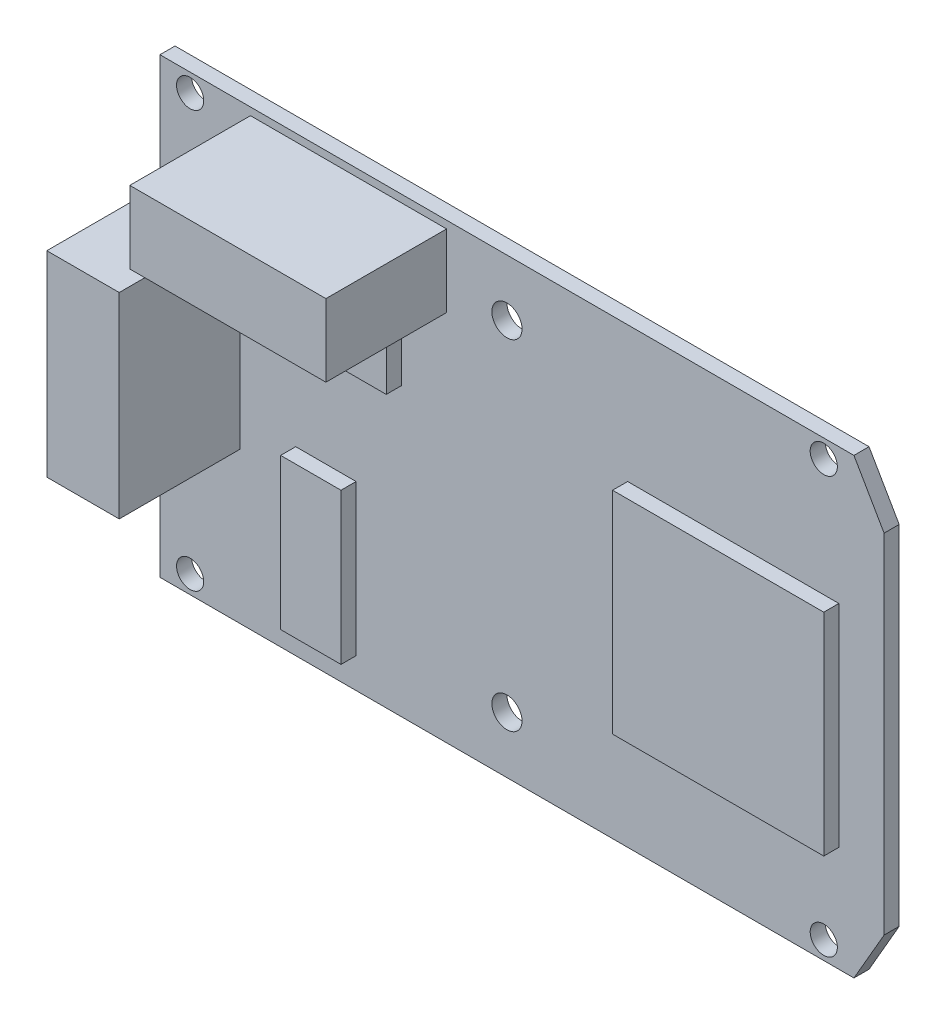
from build123d import *

# Parameters (mm, degrees)
ESQUISSE1_W             = 48
ESQUISSE1_H             = 30
EXTRUSION1_DEPTH        = 1
ESQUISSE2_W             = 14
ESQUISSE2_H             = 14
ESQUISSE2_W_2           = 4
ESQUISSE2_H_2           = 10
ESQUISSE2_W_3           = 10
ESQUISSE2_H_3           = 4
EXTRUSION2_DEPTH        = 1
ESQUISSE3_W             = 4.8
ESQUISSE3_H             = 13
ESQUISSE3_W_2           = 13
ESQUISSE3_H_2           = 4.8
EXTRUSION3_DEPTH        = 8
ESQUISSE4_W             = 13
ESQUISSE4_H             = 4.8
EXTRUSION4_DEPTH        = 8
ESQUISSE5_W             = 4
ESQUISSE5_H             = 10
ESQUISSE5_W_2           = 11
ESQUISSE5_H_2           = 11
EXTRUSION5_DEPTH        = 1
ENL_V_MAT_EXTRU_1_REACH = 31.698
ESQUISSE6_R             = 1
CHANFREIN1_SIZE         = 2
CHANFREIN1_SIZE2        = 3.464101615
CHANFREIN2_SIZE         = 2
CHANFREIN2_SIZE2        = 3.464101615
ENL_V_MAT_EXTRU_2_REACH = 31.698
ESQUISSE7_R             = 0.9


with BuildPart() as part:
    # Esquisse1 → Extrusion1 (new body)
    with BuildSketch(Plane.XY):
        Rectangle(ESQUISSE1_W, ESQUISSE1_H)
    extrude(amount=EXTRUSION1_DEPTH)

    # Esquisse2 → Extrusion2 (add)
    with BuildSketch(Plane.XY.offset(1)):
        with Locations((14, -1)):
            Rectangle(ESQUISSE2_W, ESQUISSE2_H)
        with Locations((-13, -8)):
            Rectangle(ESQUISSE2_W_2, ESQUISSE2_H_2)
        with Locations((-13, 6)):
            Rectangle(ESQUISSE2_W_3, ESQUISSE2_H_3)
    extrude(amount=EXTRUSION2_DEPTH)

    # Esquisse3 → Extrusion3 (add)
    with BuildSketch(Plane.XY.offset(1)):
        with Locations((-21.1, 1.5)):
            Rectangle(ESQUISSE3_W, ESQUISSE3_H)
        with Locations((-11.5, 12.1)):
            Rectangle(ESQUISSE3_W_2, ESQUISSE3_H_2)
    extrude(amount=EXTRUSION3_DEPTH)

    # Esquisse4 → Extrusion4 (add)
    with BuildSketch(Plane(origin=(0, 0, 0), x_dir=(-1, 0, 0), z_dir=(0, 0, -1))):
        with Locations((-8, -12.4)):
            Rectangle(ESQUISSE4_W, ESQUISSE4_H)
    extrude(amount=EXTRUSION4_DEPTH)

    # Esquisse5 → Extrusion5 (add)
    with BuildSketch(Plane(origin=(0, 0, 0), x_dir=(-1, 0, 0), z_dir=(0, 0, -1))):
        with Locations((15, 2)):
            Rectangle(ESQUISSE5_W, ESQUISSE5_H)
        with Locations((0.5, -0.5)):
            Rectangle(ESQUISSE5_W_2, ESQUISSE5_H_2)
    extrude(amount=EXTRUSION5_DEPTH)

    # Esquisse6 → Enl_v. mat.-Extru.1 (cut, up to next)
    with BuildSketch(Plane.XY.offset(1), mode=Mode.PRIVATE) as enl_v_mat_extru_1_sk1:
        with Locations((-1, -11.25)):
            Circle(ESQUISSE6_R)
    enl_v_mat_extru_1_tool1 = extrude(enl_v_mat_extru_1_sk1.sketch, amount=-ENL_V_MAT_EXTRU_1_REACH, mode=Mode.PRIVATE) & part.part
    # Esquisse6 → Enl_v. mat.-Extru.1 (cut, up to next)
    with BuildSketch(Plane.XY.offset(1), mode=Mode.PRIVATE) as enl_v_mat_extru_1_sk2:
        with Locations((-1, 11.25)):
            Circle(ESQUISSE6_R)
    enl_v_mat_extru_1_tool2 = extrude(enl_v_mat_extru_1_sk2.sketch, amount=-ENL_V_MAT_EXTRU_1_REACH, mode=Mode.PRIVATE) & part.part
    add(enl_v_mat_extru_1_tool1.solids().sort_by_distance((-1, -11.25, 1))[0], mode=Mode.SUBTRACT)
    add(enl_v_mat_extru_1_tool2.solids().sort_by_distance((-1, 11.25, 1))[0], mode=Mode.SUBTRACT)

    # Chanfrein1
    chanfrein1_edges = [part.edges().sort_by_distance(p)[0] for p in [
        (24, 15, 0.5),
    ]]
    chanfrein1_side = [part.faces().sort_by_distance(p)[0] for p in [
        (0, 15, 0.5),
    ]]
    chamfer(chanfrein1_edges, length=CHANFREIN1_SIZE, length2=CHANFREIN1_SIZE2, reference=chanfrein1_side[0])

    # Chanfrein2
    chanfrein2_edges = [part.edges().sort_by_distance(p)[0] for p in [
        (24, -15, 0.5),
    ]]
    chanfrein2_side = [part.faces().sort_by_distance(p)[0] for p in [
        (0, -15, 0.5),
    ]]
    chamfer(chanfrein2_edges, length=CHANFREIN2_SIZE, length2=CHANFREIN2_SIZE2, reference=chanfrein2_side[0])

    # Esquisse7 → Enl_v. mat.-Extru.2 (cut, up to next)
    with BuildSketch(Plane.XY.offset(1), mode=Mode.PRIVATE) as enl_v_mat_extru_2_sk1:
        with Locations((-22, 13.8)):
            Circle(ESQUISSE7_R)
    enl_v_mat_extru_2_tool1 = extrude(enl_v_mat_extru_2_sk1.sketch, amount=-ENL_V_MAT_EXTRU_2_REACH, mode=Mode.PRIVATE) & part.part
    # Esquisse7 → Enl_v. mat.-Extru.2 (cut, up to next)
    with BuildSketch(Plane.XY.offset(1), mode=Mode.PRIVATE) as enl_v_mat_extru_2_sk2:
        with Locations((-22, -13.8)):
            Circle(ESQUISSE7_R)
    enl_v_mat_extru_2_tool2 = extrude(enl_v_mat_extru_2_sk2.sketch, amount=-ENL_V_MAT_EXTRU_2_REACH, mode=Mode.PRIVATE) & part.part
    # Esquisse7 → Enl_v. mat.-Extru.2 (cut, up to next)
    with BuildSketch(Plane.XY.offset(1), mode=Mode.PRIVATE) as enl_v_mat_extru_2_sk3:
        with Locations((20, 13.8)):
            Circle(ESQUISSE7_R)
    enl_v_mat_extru_2_tool3 = extrude(enl_v_mat_extru_2_sk3.sketch, amount=-ENL_V_MAT_EXTRU_2_REACH, mode=Mode.PRIVATE) & part.part
    # Esquisse7 → Enl_v. mat.-Extru.2 (cut, up to next)
    with BuildSketch(Plane.XY.offset(1), mode=Mode.PRIVATE) as enl_v_mat_extru_2_sk4:
        with Locations((20, -13.8)):
            Circle(ESQUISSE7_R)
    enl_v_mat_extru_2_tool4 = extrude(enl_v_mat_extru_2_sk4.sketch, amount=-ENL_V_MAT_EXTRU_2_REACH, mode=Mode.PRIVATE) & part.part
    add(enl_v_mat_extru_2_tool1.solids().sort_by_distance((-22, 13.8, 1))[0], mode=Mode.SUBTRACT)
    add(enl_v_mat_extru_2_tool2.solids().sort_by_distance((-22, -13.8, 1))[0], mode=Mode.SUBTRACT)
    add(enl_v_mat_extru_2_tool3.solids().sort_by_distance((20, 13.8, 1))[0], mode=Mode.SUBTRACT)
    add(enl_v_mat_extru_2_tool4.solids().sort_by_distance((20, -13.8, 1))[0], mode=Mode.SUBTRACT)


solid = part.part
